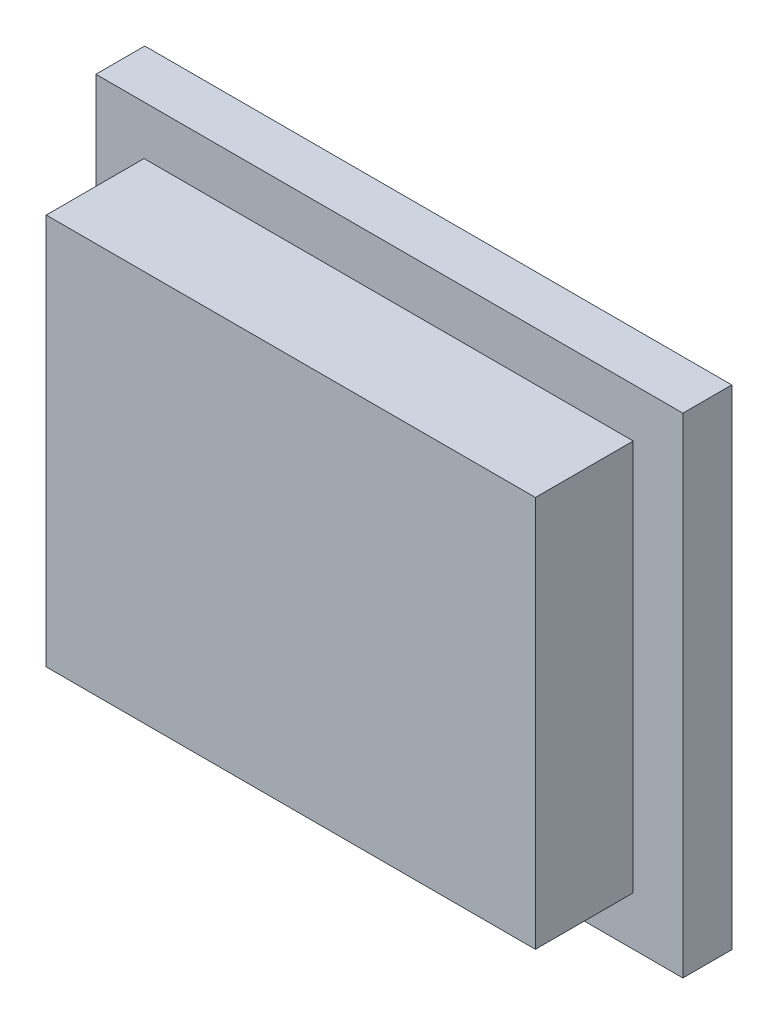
from build123d import *

# Parameters (mm, degrees)
CROQUIS1_W              = 10
CROQUIS1_H              = 8
SALIENTE_EXTRUIR1_DEPTH = 2
CROQUIS2_W              = 12
CROQUIS2_H              = 10
SALIENTE_EXTRUIR2_DEPTH = 1


with BuildPart() as part:
    # Croquis1 → Saliente-Extruir1 (new body)
    with BuildSketch(Plane.XY):
        with Locations((18.601148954, -9.107162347)):
            Rectangle(CROQUIS1_W, CROQUIS1_H)
    extrude(amount=SALIENTE_EXTRUIR1_DEPTH)

    # Croquis2 → Saliente-Extruir2 (add)
    with BuildSketch(Plane(origin=(0, 0, 0), x_dir=(-1, 0, 0), z_dir=(0, 0, -1))):
        with Locations((-18.615974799, -9.107162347)):
            Rectangle(CROQUIS2_W, CROQUIS2_H)
    extrude(amount=SALIENTE_EXTRUIR2_DEPTH)


solid = part.part
